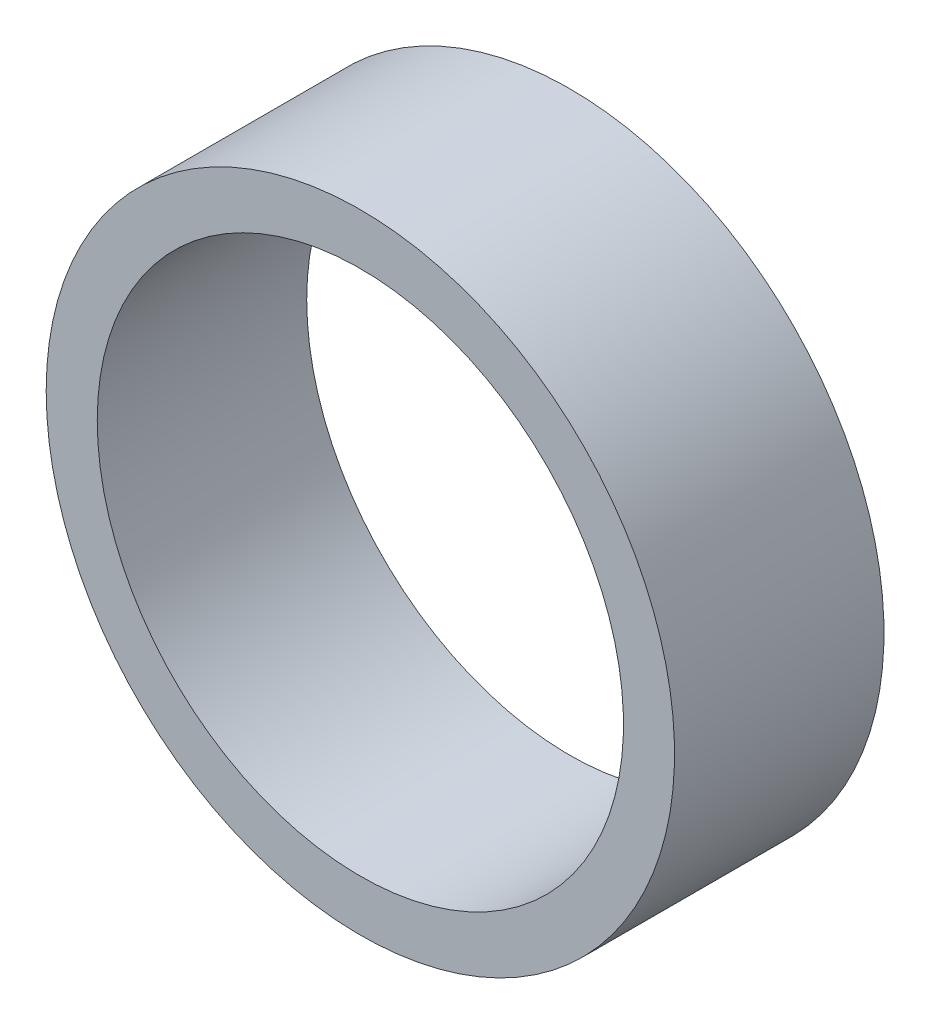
ISO-10303-21;
HEADER;
FILE_DESCRIPTION(('STEP AP214'),'2;1');
FILE_NAME('part.step','',(''),(''),'','','');
FILE_SCHEMA(('AUTOMOTIVE_DESIGN { 1 0 10303 214 1 1 1 1 }'));
ENDSEC;
DATA;
#1=APPLICATION_CONTEXT('core data for automotive mechanical design processes');
#2=APPLICATION_PROTOCOL_DEFINITION('international standard','automotive_design',2000,#1);
#3=PRODUCT_CONTEXT('',#1,'mechanical');
#4=PRODUCT('Part','Part','',(#3));
#5=PRODUCT_RELATED_PRODUCT_CATEGORY('part','',(#4));
#6=PRODUCT_DEFINITION_FORMATION('','',#4);
#7=PRODUCT_DEFINITION_CONTEXT('part definition',#1,'design');
#8=PRODUCT_DEFINITION('design','',#6,#7);
#9=PRODUCT_DEFINITION_SHAPE('','',#8);
#10=(LENGTH_UNIT() NAMED_UNIT(*) SI_UNIT(.MILLI.,.METRE.));
#11=(NAMED_UNIT(*) PLANE_ANGLE_UNIT() SI_UNIT($,.RADIAN.));
#12=(NAMED_UNIT(*) SI_UNIT($,.STERADIAN.) SOLID_ANGLE_UNIT());
#13=UNCERTAINTY_MEASURE_WITH_UNIT(LENGTH_MEASURE(1.E-05),#10,'distance_accuracy_value','');
#14=(GEOMETRIC_REPRESENTATION_CONTEXT(3) GLOBAL_UNCERTAINTY_ASSIGNED_CONTEXT((#13)) GLOBAL_UNIT_ASSIGNED_CONTEXT((#10,
#11,#12)) REPRESENTATION_CONTEXT('',''));
#15=CARTESIAN_POINT('',(0.,0.,0.));
#16=DIRECTION('',(0.,0.,1.));
#17=DIRECTION('',(1.,0.,0.));
#18=AXIS2_PLACEMENT_3D('',#15,#16,#17);
#19=CARTESIAN_POINT('',(0.,0.,-38.9763628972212));
#20=DIRECTION('',(0.,0.,-1.));
#21=DIRECTION('',(-1.,0.,0.));
#22=AXIS2_PLACEMENT_3D('',#19,#20,#21);
#23=CYLINDRICAL_SURFACE('',#22,7.977);
#24=CARTESIAN_POINT('',(0.,0.,6.34999999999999));
#25=DIRECTION('',(0.,0.,-1.));
#26=DIRECTION('',(-1.,0.,0.));
#27=AXIS2_PLACEMENT_3D('',#24,#25,#26);
#28=CIRCLE('',#27,7.977);
#29=CARTESIAN_POINT('',(-7.977,0.,6.34999999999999));
#30=VERTEX_POINT('',#29);
#31=EDGE_CURVE('E58',#30,#30,#28,.T.);
#32=ORIENTED_EDGE('',*,*,#31,.F.);
#33=EDGE_LOOP('',(#32));
#34=FACE_BOUND('',#33,.T.);
#35=CARTESIAN_POINT('',(0.,0.,0.));
#36=DIRECTION('',(0.,0.,-1.));
#37=DIRECTION('',(-1.,0.,0.));
#38=AXIS2_PLACEMENT_3D('',#35,#36,#37);
#39=CIRCLE('',#38,7.977);
#40=CARTESIAN_POINT('',(-7.977,0.,0.));
#41=VERTEX_POINT('',#40);
#42=EDGE_CURVE('E10',#41,#41,#39,.T.);
#43=ORIENTED_EDGE('',*,*,#42,.T.);
#44=EDGE_LOOP('',(#43));
#45=FACE_BOUND('',#44,.T.);
#46=ADVANCED_FACE('F39',(#34,#45),#23,.F.);
#47=CARTESIAN_POINT('',(-9.52500000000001,0.,0.));
#48=DIRECTION('',(0.,0.,1.));
#49=DIRECTION('',(1.,0.,0.));
#50=AXIS2_PLACEMENT_3D('',#47,#48,#49);
#51=PLANE('',#50);
#52=ORIENTED_EDGE('',*,*,#42,.F.);
#53=EDGE_LOOP('',(#52));
#54=FACE_BOUND('',#53,.T.);
#55=CARTESIAN_POINT('',(0.,0.,0.));
#56=DIRECTION('',(0.,0.,-1.));
#57=DIRECTION('',(-1.,0.,0.));
#58=AXIS2_PLACEMENT_3D('',#55,#56,#57);
#59=CIRCLE('',#58,9.525);
#60=CARTESIAN_POINT('',(-9.525,0.,0.));
#61=VERTEX_POINT('',#60);
#62=EDGE_CURVE('E46',#61,#61,#59,.T.);
#63=ORIENTED_EDGE('',*,*,#62,.T.);
#64=EDGE_LOOP('',(#63));
#65=FACE_BOUND('',#64,.T.);
#66=ADVANCED_FACE('F69',(#54,#65),#51,.F.);
#67=CARTESIAN_POINT('',(0.,0.,-38.9763628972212));
#68=DIRECTION('',(0.,0.,-1.));
#69=DIRECTION('',(-1.,0.,0.));
#70=AXIS2_PLACEMENT_3D('',#67,#68,#69);
#71=CYLINDRICAL_SURFACE('',#70,9.525);
#72=ORIENTED_EDGE('',*,*,#62,.F.);
#73=EDGE_LOOP('',(#72));
#74=FACE_BOUND('',#73,.T.);
#75=CARTESIAN_POINT('',(0.,0.,6.34999999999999));
#76=DIRECTION('',(0.,0.,-1.));
#77=DIRECTION('',(-1.,0.,0.));
#78=AXIS2_PLACEMENT_3D('',#75,#76,#77);
#79=CIRCLE('',#78,9.525);
#80=CARTESIAN_POINT('',(-9.525,0.,6.34999999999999));
#81=VERTEX_POINT('',#80);
#82=EDGE_CURVE('E52',#81,#81,#79,.T.);
#83=ORIENTED_EDGE('',*,*,#82,.T.);
#84=EDGE_LOOP('',(#83));
#85=FACE_BOUND('',#84,.T.);
#86=ADVANCED_FACE('F73',(#74,#85),#71,.T.);
#87=CARTESIAN_POINT('',(-7.97700000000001,0.,6.34999999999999));
#88=DIRECTION('',(0.,0.,-1.));
#89=DIRECTION('',(-1.,0.,0.));
#90=AXIS2_PLACEMENT_3D('',#87,#88,#89);
#91=PLANE('',#90);
#92=ORIENTED_EDGE('',*,*,#82,.F.);
#93=EDGE_LOOP('',(#92));
#94=FACE_BOUND('',#93,.T.);
#95=ORIENTED_EDGE('',*,*,#31,.T.);
#96=EDGE_LOOP('',(#95));
#97=FACE_BOUND('',#96,.T.);
#98=ADVANCED_FACE('F66',(#94,#97),#91,.F.);
#99=CLOSED_SHELL('',(#46,#66,#86,#98));
#100=MANIFOLD_SOLID_BREP('B2',#99);
#101=ADVANCED_BREP_SHAPE_REPRESENTATION('',(#18,#100),#14);
#102=SHAPE_DEFINITION_REPRESENTATION(#9,#101);
ENDSEC;
END-ISO-10303-21;
